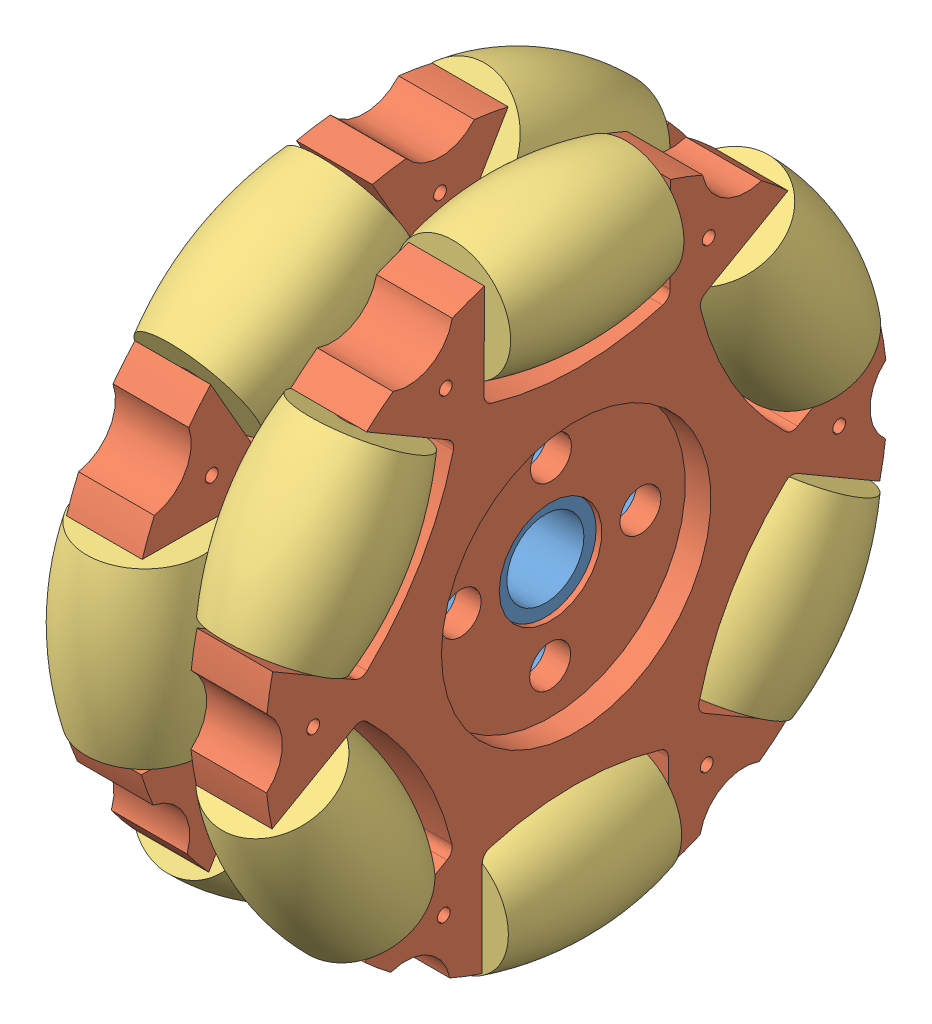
SolidWorks assembly 航发两寸全向轮.SLDASM, configuration 默认 (file format 9000). Lengths in mm.
Overall size (25.96 55.31 55.33).
15 component instances, 3 part files, 11 mates.
Components (placement in the parent):
- 小轮法兰-1: 小轮法兰.SLDPRT [默认] at (0 -24.8887 14.9321) x (0 -0.99999 0.004436) z (0 0.004436 0.99999) size (19 11.8 19)
- 2寸全向轮轮架-1: 2寸全向轮轮架.SLDPRT [默认] at (-5.275 -24.8887 14.9321) x (0 -0.99999 0.004436) z (0 0.004436 0.99999) size (48.21 5.9 46.28)
- 2寸全向轮轮架-2: 2寸全向轮轮架.SLDPRT [默认] at (5.325 -24.8887 14.9321) x (0 0.004436 0.99999) z (0 -0.99999 0.004436) size (48.21 5.9 46.28)
- 小滚轮-1: 小滚轮.SLDPRT [默认] at (-5.325 -24.8 34.9319) x (0.71018 -0.003123 -0.704014) z (0 -0.99999 0.004436) size (10.8 10.8 13.5)
- 小滚轮-8: 小滚轮.SLDPRT [默认] at (5.375 -14.812 32.2081) x (0.742219 0.337649 0.578881) z (0 -0.863799 0.503836) size (10.8 10.8 13.5)
- 小滚轮-3: 小滚轮.SLDPRT [默认] at (-5.325 -7.524 24.8552) x (0.71018 -0.611255 -0.349302) z (0 -0.496154 0.868235) size (10.8 10.8 13.5)
- 小滚轮-4: 小滚轮.SLDPRT [默认] at (-5.325 -7.6128 4.8554) x (0.71018 -0.608132 0.354711) z (0 0.503836 0.863799) size (10.8 10.8 13.5)
- 小滚轮-5: 小滚轮.SLDPRT [默认] at (-5.325 -24.9775 -5.0677) x (0.71018 0.003123 0.704014) z (0 0.99999 -0.004436) size (10.8 10.8 13.5)
- 小滚轮-6: 小滚轮.SLDPRT [默认] at (-5.325 -42.2534 5.009) x (0.71018 0.611255 0.349302) z (0 0.496154 -0.868235) size (10.8 10.8 13.5)
- 小滚轮-7: 小滚轮.SLDPRT [默认] at (-5.325 -42.1647 25.0088) x (0.71018 0.608132 -0.354711) z (0 -0.503836 -0.863799) size (10.8 10.8 13.5)
- 小滚轮-9: 小滚轮.SLDPRT [默认] at (5.375 -4.8889 14.8434) x (0.742219 0.67015 -0.002973) z (0 0.004436 0.99999) size (10.8 10.8 13.5)
- 小滚轮-10: 小滚轮.SLDPRT [默认] at (5.375 -14.9657 -2.4326) x (0.742219 0.332501 -0.581854) z (0 0.868235 0.496154) size (10.8 10.8 13.5)
- 小滚轮-11: 小滚轮.SLDPRT [默认] at (5.375 -34.9655 -2.3439) x (0.742219 -0.337649 -0.578881) z (0 0.863799 -0.503836) size (10.8 10.8 13.5)
- 小滚轮-12: 小滚轮.SLDPRT [默认] at (5.375 -44.8885 15.0208) x (0.742219 -0.67015 0.002973) z (0 -0.004436 -0.99999) size (10.8 10.8 13.5)
- 小滚轮-13: 小滚轮.SLDPRT [默认] at (5.375 -34.8118 32.2968) x (0.742219 -0.332501 0.581854) z (0 -0.868235 -0.496154) size (10.8 10.8 13.5)
Mates (geometry in assembly coordinates):
- 距离1: distance = 4.375 mm anti-aligned: plane of assembly through (0 0 0) normal (1 0 0); plane of 小轮法兰-1 through (-4.375 -34.3886 14.9742) normal (-1 0 0)
- 同心1: concentric anti-aligned: cylinder of 小轮法兰-1 through (-5.875 -24.8887 14.9321) axis (1 0 0) radius 3.95; cylinder of 2寸全向轮轮架-1 through (-2.375 -24.8887 14.9321) axis (-1 0 0) radius 4
- 同心2: concentric aligned: cylinder of 小轮法兰-1 through (-4.375 -24.8577 21.932) axis (-1 0 0) radius 1.6; cylinder of 2寸全向轮轮架-1 through (-6.275 -24.8577 21.932) axis (-1 0 0) radius 1.6
- 同心3: concentric anti-aligned: cylinder of 小轮法兰-1 through (-5.875 -24.8887 14.9321) axis (-1 0 0) radius 3; cylinder of 2寸全向轮轮架-2 through (2.425 -24.8887 14.9321) axis (1 0 0) radius 4
- 同心5: concentric anti-aligned: cylinder of 小轮法兰-1 through (-4.375 -31.8887 14.9631) axis (-1 0 0) radius 1.6; cylinder of 2寸全向轮轮架-2 through (6.325 -31.8887 14.9631) axis (1 0 0) radius 1.6
- 同心6: concentric anti-aligned: cylinder of 2寸全向轮轮架-1 through (-5.325 -32.05 34.964) axis (0 0.99999 -0.004436) radius 1.5; cylinder of 小滚轮-1 through (-5.325 -18.0501 34.9019) axis (0 -0.99999 0.004436) radius 1.5
- 距离2: distance = 0.5 mm anti-aligned: plane of 小滚轮-1 through (-2.1292 -18.0641 31.7339) normal (0 0.99999 -0.004436); plane of 2寸全向轮轮架-1 through (-8.275 -17.5717 30.0406) normal (0 -0.99999 0.004436)
- 距离3: distance = 0.5 mm anti-aligned: plane of 小滚轮-8 through (6.4883 -20.1362 36.4773) normal (0 -0.863799 0.503836); plane of 2寸全向轮轮架-2 through (8.325 -23.5228 31.6636) normal (0 0.863799 -0.503836)
- 同心7: concentric aligned: cylinder of 小滚轮-8 through (5.375 -8.9814 28.8072) axis (0 -0.863799 0.503836) radius 1.5; cylinder of 2寸全向轮轮架-2 through (5.375 -8.5495 28.5553) axis (0 -0.863799 0.503836) radius 1.5
- 重合5: coincident anti-aligned: plane of 小轮法兰-1 through (-4.375 -34.3886 14.9742) normal (-1 0 0); plane of 2寸全向轮轮架-1 through (-4.375 -28.8887 14.9498) normal (1 0 0)
- 重合6: coincident anti-aligned: plane of 小轮法兰-1 through (4.425 -24.8887 14.9321) normal (1 0 0); plane of 2寸全向轮轮架-2 through (4.425 -24.871 18.932) normal (-1 0 0)
